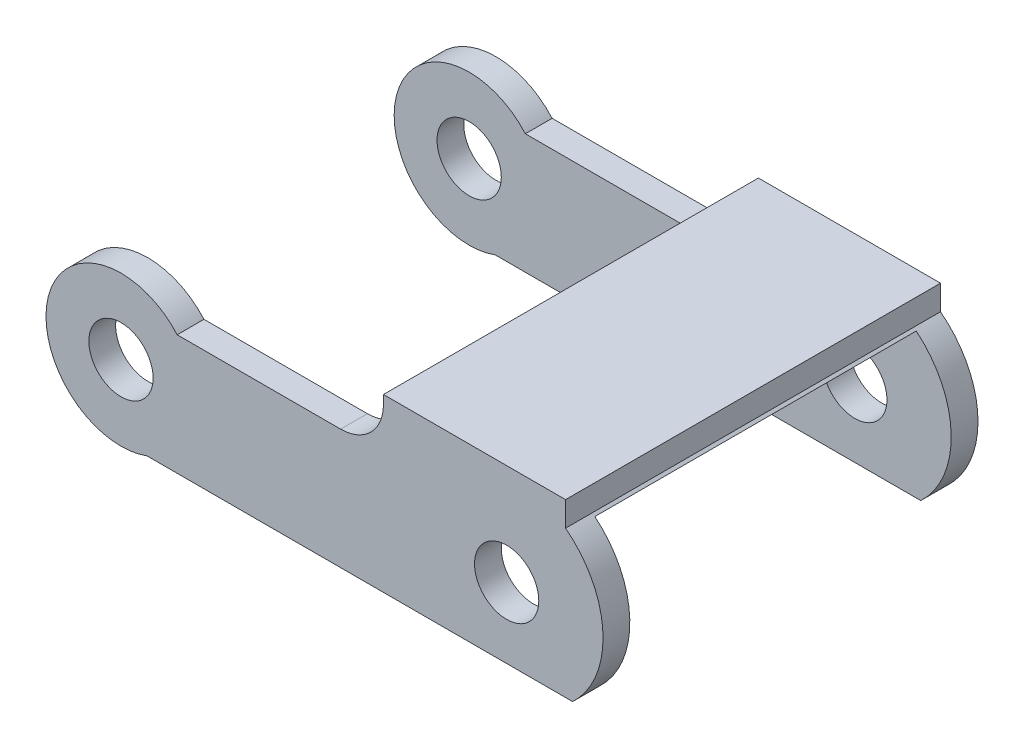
ISO-10303-21;
HEADER;
FILE_DESCRIPTION(('STEP AP214'),'2;1');
FILE_NAME('part.step','',(''),(''),'','','');
FILE_SCHEMA(('AUTOMOTIVE_DESIGN { 1 0 10303 214 1 1 1 1 }'));
ENDSEC;
DATA;
#1=APPLICATION_CONTEXT('core data for automotive mechanical design processes');
#2=APPLICATION_PROTOCOL_DEFINITION('international standard','automotive_design',2000,#1);
#3=PRODUCT_CONTEXT('',#1,'mechanical');
#4=PRODUCT('Part','Part','',(#3));
#5=PRODUCT_RELATED_PRODUCT_CATEGORY('part','',(#4));
#6=PRODUCT_DEFINITION_FORMATION('','',#4);
#7=PRODUCT_DEFINITION_CONTEXT('part definition',#1,'design');
#8=PRODUCT_DEFINITION('design','',#6,#7);
#9=PRODUCT_DEFINITION_SHAPE('','',#8);
#10=(LENGTH_UNIT() NAMED_UNIT(*) SI_UNIT(.MILLI.,.METRE.));
#11=(NAMED_UNIT(*) PLANE_ANGLE_UNIT() SI_UNIT($,.RADIAN.));
#12=(NAMED_UNIT(*) SI_UNIT($,.STERADIAN.) SOLID_ANGLE_UNIT());
#13=UNCERTAINTY_MEASURE_WITH_UNIT(LENGTH_MEASURE(1.E-05),#10,'distance_accuracy_value','');
#14=(GEOMETRIC_REPRESENTATION_CONTEXT(3) GLOBAL_UNCERTAINTY_ASSIGNED_CONTEXT((#13)) GLOBAL_UNIT_ASSIGNED_CONTEXT((#10,
#11,#12)) REPRESENTATION_CONTEXT('',''));
#15=CARTESIAN_POINT('',(0.,0.,0.));
#16=DIRECTION('',(0.,0.,1.));
#17=DIRECTION('',(1.,0.,0.));
#18=AXIS2_PLACEMENT_3D('',#15,#16,#17);
#19=CARTESIAN_POINT('',(-15.3771217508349,2.31743601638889,0.));
#20=DIRECTION('',(0.,1.,0.));
#21=DIRECTION('',(0.,0.,1.));
#22=AXIS2_PLACEMENT_3D('',#19,#20,#21);
#23=PLANE('',#22);
#24=DIRECTION('',(1.,0.,0.));
#25=VECTOR('',#24,1.);
#26=CARTESIAN_POINT('',(-8.08995792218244,2.3174360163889,-8.75));
#27=LINE('',#26,#25);
#28=CARTESIAN_POINT('',(-7.75,2.3174360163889,-8.75));
#29=VERTEX_POINT('',#28);
#30=CARTESIAN_POINT('',(-15.3771217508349,2.3174360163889,-8.75));
#31=VERTEX_POINT('',#30);
#32=EDGE_CURVE('E109',#29,#31,#27,.F.);
#33=ORIENTED_EDGE('',*,*,#32,.T.);
#34=DIRECTION('',(0.,0.,1.));
#35=VECTOR('',#34,1.);
#36=CARTESIAN_POINT('',(-15.3771217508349,2.31743601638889,0.));
#37=LINE('',#36,#35);
#38=CARTESIAN_POINT('',(-15.3771217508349,2.31743601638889,-7.5));
#39=VERTEX_POINT('',#38);
#40=EDGE_CURVE('E127',#39,#31,#37,.F.);
#41=ORIENTED_EDGE('',*,*,#40,.F.);
#42=DIRECTION('',(-1.,0.,0.));
#43=VECTOR('',#42,1.);
#44=CARTESIAN_POINT('',(7.84633971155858,2.31743601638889,-7.50000000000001));
#45=LINE('',#44,#43);
#46=CARTESIAN_POINT('',(-7.75,2.31743601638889,-7.5));
#47=VERTEX_POINT('',#46);
#48=EDGE_CURVE('E228',#39,#47,#45,.F.);
#49=ORIENTED_EDGE('',*,*,#48,.T.);
#50=DIRECTION('',(0.,0.,1.));
#51=VECTOR('',#50,1.);
#52=CARTESIAN_POINT('',(-7.75,2.31743601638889,0.));
#53=LINE('',#52,#51);
#54=EDGE_CURVE('E160',#47,#29,#53,.F.);
#55=ORIENTED_EDGE('',*,*,#54,.T.);
#56=EDGE_LOOP('',(#33,#41,#49,#55));
#57=FACE_BOUND('',#56,.T.);
#58=ADVANCED_FACE('F16',(#57),#23,.T.);
#59=CARTESIAN_POINT('',(3.07811203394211,-3.2825639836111,0.));
#60=DIRECTION('',(0.,-1.,0.));
#61=DIRECTION('',(0.,0.,-1.));
#62=AXIS2_PLACEMENT_3D('',#59,#60,#61);
#63=PLANE('',#62);
#64=DIRECTION('',(1.,0.,0.));
#65=VECTOR('',#64,1.);
#66=CARTESIAN_POINT('',(-8.08995792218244,-3.2825639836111,-8.75));
#67=LINE('',#66,#65);
#68=CARTESIAN_POINT('',(-16.7855973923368,-3.2825639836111,-8.75));
#69=VERTEX_POINT('',#68);
#70=CARTESIAN_POINT('',(3.07811203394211,-3.2825639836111,-8.75));
#71=VERTEX_POINT('',#70);
#72=EDGE_CURVE('E119',#69,#71,#67,.T.);
#73=ORIENTED_EDGE('',*,*,#72,.T.);
#74=DIRECTION('',(0.,0.,-1.));
#75=VECTOR('',#74,1.);
#76=CARTESIAN_POINT('',(3.07811203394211,-3.2825639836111,0.));
#77=LINE('',#76,#75);
#78=CARTESIAN_POINT('',(3.07811203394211,-3.2825639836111,-7.50000000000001));
#79=VERTEX_POINT('',#78);
#80=EDGE_CURVE('E158',#71,#79,#77,.F.);
#81=ORIENTED_EDGE('',*,*,#80,.T.);
#82=DIRECTION('',(-1.,0.,0.));
#83=VECTOR('',#82,1.);
#84=CARTESIAN_POINT('',(7.84633971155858,-3.2825639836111,-7.50000000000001));
#85=LINE('',#84,#83);
#86=CARTESIAN_POINT('',(-16.7855973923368,-3.2825639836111,-7.5));
#87=VERTEX_POINT('',#86);
#88=EDGE_CURVE('E122',#79,#87,#85,.T.);
#89=ORIENTED_EDGE('',*,*,#88,.T.);
#90=DIRECTION('',(0.,0.,1.));
#91=VECTOR('',#90,1.);
#92=CARTESIAN_POINT('',(-16.7855973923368,-3.2825639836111,0.));
#93=LINE('',#92,#91);
#94=EDGE_CURVE('E115',#69,#87,#93,.T.);
#95=ORIENTED_EDGE('',*,*,#94,.F.);
#96=EDGE_LOOP('',(#73,#81,#89,#95));
#97=FACE_BOUND('',#96,.T.);
#98=ADVANCED_FACE('F117',(#97),#63,.T.);
#99=CARTESIAN_POINT('',(-18.,0.,0.));
#100=DIRECTION('',(0.,0.,1.));
#101=DIRECTION('',(1.,0.,0.));
#102=AXIS2_PLACEMENT_3D('',#99,#100,#101);
#103=CYLINDRICAL_SURFACE('',#102,3.5);
#104=CARTESIAN_POINT('',(-18.,0.,-8.75));
#105=DIRECTION('',(0.,0.,1.));
#106=DIRECTION('',(1.,0.,0.));
#107=AXIS2_PLACEMENT_3D('',#104,#105,#106);
#108=CIRCLE('',#107,3.5);
#109=EDGE_CURVE('E19',#31,#69,#108,.T.);
#110=ORIENTED_EDGE('',*,*,#109,.T.);
#111=ORIENTED_EDGE('',*,*,#94,.T.);
#112=CARTESIAN_POINT('',(-18.,0.,-7.5));
#113=DIRECTION('',(0.,0.,1.));
#114=DIRECTION('',(1.,0.,0.));
#115=AXIS2_PLACEMENT_3D('',#112,#113,#114);
#116=CIRCLE('',#115,3.5);
#117=EDGE_CURVE('E220',#87,#39,#116,.F.);
#118=ORIENTED_EDGE('',*,*,#117,.T.);
#119=ORIENTED_EDGE('',*,*,#40,.T.);
#120=EDGE_LOOP('',(#110,#111,#118,#119));
#121=FACE_BOUND('',#120,.T.);
#122=ADVANCED_FACE('F130',(#121),#103,.T.);
#123=CARTESIAN_POINT('',(0.,0.,0.));
#124=DIRECTION('',(0.,0.,1.));
#125=DIRECTION('',(1.,0.,0.));
#126=AXIS2_PLACEMENT_3D('',#123,#124,#125);
#127=CYLINDRICAL_SURFACE('',#126,1.5);
#128=CARTESIAN_POINT('',(0.,0.,-8.75));
#129=DIRECTION('',(0.,0.,1.));
#130=DIRECTION('',(1.,0.,0.));
#131=AXIS2_PLACEMENT_3D('',#128,#129,#130);
#132=CIRCLE('',#131,1.5);
#133=CARTESIAN_POINT('',(1.5,0.,-8.75));
#134=VERTEX_POINT('',#133);
#135=EDGE_CURVE('E138',#134,#134,#132,.F.);
#136=ORIENTED_EDGE('',*,*,#135,.T.);
#137=EDGE_LOOP('',(#136));
#138=FACE_BOUND('',#137,.T.);
#139=CARTESIAN_POINT('',(0.,0.,-7.50000000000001));
#140=DIRECTION('',(0.,0.,1.));
#141=DIRECTION('',(1.,0.,0.));
#142=AXIS2_PLACEMENT_3D('',#139,#140,#141);
#143=CIRCLE('',#142,1.5);
#144=CARTESIAN_POINT('',(1.5,0.,-7.50000000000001));
#145=VERTEX_POINT('',#144);
#146=EDGE_CURVE('E217',#145,#145,#143,.T.);
#147=ORIENTED_EDGE('',*,*,#146,.T.);
#148=EDGE_LOOP('',(#147));
#149=FACE_BOUND('',#148,.T.);
#150=ADVANCED_FACE('F347',(#138,#149),#127,.F.);
#151=CARTESIAN_POINT('',(-18.,0.,0.));
#152=DIRECTION('',(0.,0.,1.));
#153=DIRECTION('',(1.,0.,0.));
#154=AXIS2_PLACEMENT_3D('',#151,#152,#153);
#155=CYLINDRICAL_SURFACE('',#154,1.5);
#156=CARTESIAN_POINT('',(-18.,0.,-8.75));
#157=DIRECTION('',(0.,0.,1.));
#158=DIRECTION('',(1.,0.,0.));
#159=AXIS2_PLACEMENT_3D('',#156,#157,#158);
#160=CIRCLE('',#159,1.5);
#161=CARTESIAN_POINT('',(-16.5,0.,-8.75));
#162=VERTEX_POINT('',#161);
#163=EDGE_CURVE('E135',#162,#162,#160,.F.);
#164=ORIENTED_EDGE('',*,*,#163,.T.);
#165=EDGE_LOOP('',(#164));
#166=FACE_BOUND('',#165,.T.);
#167=CARTESIAN_POINT('',(-18.,0.,-7.50000000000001));
#168=DIRECTION('',(0.,0.,1.));
#169=DIRECTION('',(1.,0.,0.));
#170=AXIS2_PLACEMENT_3D('',#167,#168,#169);
#171=CIRCLE('',#170,1.5);
#172=CARTESIAN_POINT('',(-16.5,0.,-7.50000000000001));
#173=VERTEX_POINT('',#172);
#174=EDGE_CURVE('E213',#173,#173,#171,.T.);
#175=ORIENTED_EDGE('',*,*,#174,.T.);
#176=EDGE_LOOP('',(#175));
#177=FACE_BOUND('',#176,.T.);
#178=ADVANCED_FACE('F344',(#166,#177),#155,.F.);
#179=CARTESIAN_POINT('',(2.75,4.7174360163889,0.));
#180=DIRECTION('',(1.,0.,0.));
#181=DIRECTION('',(0.,0.,-1.));
#182=AXIS2_PLACEMENT_3D('',#179,#180,#181);
#183=PLANE('',#182);
#184=DIRECTION('',(0.,1.,0.));
#185=VECTOR('',#184,1.);
#186=CARTESIAN_POINT('',(2.75,0.219715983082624,-8.75));
#187=LINE('',#186,#185);
#188=CARTESIAN_POINT('',(2.75,3.56195171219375,-8.75));
#189=VERTEX_POINT('',#188);
#190=CARTESIAN_POINT('',(2.75,4.7174360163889,-8.75));
#191=VERTEX_POINT('',#190);
#192=EDGE_CURVE('E144',#189,#191,#187,.T.);
#193=ORIENTED_EDGE('',*,*,#192,.T.);
#194=DIRECTION('',(0.,0.,1.));
#195=VECTOR('',#194,1.);
#196=CARTESIAN_POINT('',(2.75,4.71743601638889,0.));
#197=LINE('',#196,#195);
#198=CARTESIAN_POINT('',(2.75,4.7174360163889,8.75));
#199=VERTEX_POINT('',#198);
#200=EDGE_CURVE('E150',#199,#191,#197,.F.);
#201=ORIENTED_EDGE('',*,*,#200,.F.);
#202=DIRECTION('',(0.,1.,0.));
#203=VECTOR('',#202,1.);
#204=CARTESIAN_POINT('',(2.75,4.7174360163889,8.75));
#205=LINE('',#204,#203);
#206=CARTESIAN_POINT('',(2.75,3.56195171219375,8.75));
#207=VERTEX_POINT('',#206);
#208=EDGE_CURVE('E126',#199,#207,#205,.F.);
#209=ORIENTED_EDGE('',*,*,#208,.T.);
#210=DIRECTION('',(0.,0.,1.));
#211=VECTOR('',#210,1.);
#212=CARTESIAN_POINT('',(2.75,3.56195171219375,0.));
#213=LINE('',#212,#211);
#214=EDGE_CURVE('E205',#189,#207,#213,.T.);
#215=ORIENTED_EDGE('',*,*,#214,.F.);
#216=EDGE_LOOP('',(#193,#201,#209,#215));
#217=FACE_BOUND('',#216,.T.);
#218=ADVANCED_FACE('F265',(#217),#183,.T.);
#219=CARTESIAN_POINT('',(-8.08995792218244,0.219715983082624,-8.75));
#220=DIRECTION('',(0.,0.,1.));
#221=DIRECTION('',(1.,0.,0.));
#222=AXIS2_PLACEMENT_3D('',#219,#220,#221);
#223=PLANE('',#222);
#224=ORIENTED_EDGE('',*,*,#135,.F.);
#225=EDGE_LOOP('',(#224));
#226=FACE_BOUND('',#225,.T.);
#227=ORIENTED_EDGE('',*,*,#163,.F.);
#228=EDGE_LOOP('',(#227));
#229=FACE_BOUND('',#228,.T.);
#230=ORIENTED_EDGE('',*,*,#109,.F.);
#231=ORIENTED_EDGE('',*,*,#32,.F.);
#232=CARTESIAN_POINT('',(-7.75,4.3174360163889,-8.75));
#233=DIRECTION('',(0.,0.,1.));
#234=DIRECTION('',(1.,0.,0.));
#235=AXIS2_PLACEMENT_3D('',#232,#233,#234);
#236=CIRCLE('',#235,2.);
#237=CARTESIAN_POINT('',(-5.75,4.3174360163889,-8.75));
#238=VERTEX_POINT('',#237);
#239=EDGE_CURVE('E165',#29,#238,#236,.T.);
#240=ORIENTED_EDGE('',*,*,#239,.T.);
#241=DIRECTION('',(0.,1.,0.));
#242=VECTOR('',#241,1.);
#243=CARTESIAN_POINT('',(-5.75,4.3174360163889,-8.75));
#244=LINE('',#243,#242);
#245=CARTESIAN_POINT('',(-5.75,4.71743601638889,-8.75));
#246=VERTEX_POINT('',#245);
#247=EDGE_CURVE('E141',#246,#238,#244,.F.);
#248=ORIENTED_EDGE('',*,*,#247,.F.);
#249=DIRECTION('',(1.,0.,0.));
#250=VECTOR('',#249,1.);
#251=CARTESIAN_POINT('',(-5.75,4.71743601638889,-8.75));
#252=LINE('',#251,#250);
#253=EDGE_CURVE('E166',#191,#246,#252,.F.);
#254=ORIENTED_EDGE('',*,*,#253,.F.);
#255=ORIENTED_EDGE('',*,*,#192,.F.);
#256=CARTESIAN_POINT('',(0.,0.,-8.75));
#257=DIRECTION('',(0.,0.,1.));
#258=DIRECTION('',(1.,0.,0.));
#259=AXIS2_PLACEMENT_3D('',#256,#257,#258);
#260=CIRCLE('',#259,4.5);
#261=EDGE_CURVE('E134',#71,#189,#260,.T.);
#262=ORIENTED_EDGE('',*,*,#261,.F.);
#263=ORIENTED_EDGE('',*,*,#72,.F.);
#264=EDGE_LOOP('',(#230,#231,#240,#248,#254,#255,#262,#263));
#265=FACE_BOUND('',#264,.T.);
#266=ADVANCED_FACE('F132',(#226,#229,#265),#223,.F.);
#267=CARTESIAN_POINT('',(-5.75,4.3174360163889,0.));
#268=DIRECTION('',(-1.,0.,0.));
#269=DIRECTION('',(0.,0.,1.));
#270=AXIS2_PLACEMENT_3D('',#267,#268,#269);
#271=PLANE('',#270);
#272=ORIENTED_EDGE('',*,*,#247,.T.);
#273=DIRECTION('',(0.,0.,1.));
#274=VECTOR('',#273,1.);
#275=CARTESIAN_POINT('',(-5.75,4.3174360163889,0.));
#276=LINE('',#275,#274);
#277=CARTESIAN_POINT('',(-5.75,4.3174360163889,8.75));
#278=VERTEX_POINT('',#277);
#279=EDGE_CURVE('E200',#238,#278,#276,.T.);
#280=ORIENTED_EDGE('',*,*,#279,.T.);
#281=DIRECTION('',(0.,1.,0.));
#282=VECTOR('',#281,1.);
#283=CARTESIAN_POINT('',(-5.75,4.3174360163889,8.75));
#284=LINE('',#283,#282);
#285=CARTESIAN_POINT('',(-5.75,4.71743601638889,8.75));
#286=VERTEX_POINT('',#285);
#287=EDGE_CURVE('E34',#278,#286,#284,.T.);
#288=ORIENTED_EDGE('',*,*,#287,.T.);
#289=DIRECTION('',(0.,0.,1.));
#290=VECTOR('',#289,1.);
#291=CARTESIAN_POINT('',(-5.75,4.71743601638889,0.));
#292=LINE('',#291,#290);
#293=EDGE_CURVE('E162',#246,#286,#292,.T.);
#294=ORIENTED_EDGE('',*,*,#293,.F.);
#295=EDGE_LOOP('',(#272,#280,#288,#294));
#296=FACE_BOUND('',#295,.T.);
#297=ADVANCED_FACE('F271',(#296),#271,.T.);
#298=CARTESIAN_POINT('',(-8.76491090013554,3.46743601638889,0.));
#299=DIRECTION('',(0.,1.,0.));
#300=DIRECTION('',(0.,0.,1.));
#301=AXIS2_PLACEMENT_3D('',#298,#299,#300);
#302=PLANE('',#301);
#303=DIRECTION('',(-1.,0.,0.));
#304=VECTOR('',#303,1.);
#305=CARTESIAN_POINT('',(7.84633971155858,3.46743601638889,-7.50000000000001));
#306=LINE('',#305,#304);
#307=CARTESIAN_POINT('',(-5.93961330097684,3.46743601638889,-7.5));
#308=VERTEX_POINT('',#307);
#309=CARTESIAN_POINT('',(2.86825512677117,3.4674360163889,-7.50000000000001));
#310=VERTEX_POINT('',#309);
#311=EDGE_CURVE('E235',#308,#310,#306,.F.);
#312=ORIENTED_EDGE('',*,*,#311,.T.);
#313=DIRECTION('',(0.,0.,1.));
#314=VECTOR('',#313,1.);
#315=CARTESIAN_POINT('',(2.86825512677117,3.4674360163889,0.));
#316=LINE('',#315,#314);
#317=CARTESIAN_POINT('',(2.86825512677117,3.4674360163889,7.5));
#318=VERTEX_POINT('',#317);
#319=EDGE_CURVE('E147',#318,#310,#316,.F.);
#320=ORIENTED_EDGE('',*,*,#319,.F.);
#321=DIRECTION('',(1.,0.,0.));
#322=VECTOR('',#321,1.);
#323=CARTESIAN_POINT('',(-25.3761615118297,3.4674360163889,7.5));
#324=LINE('',#323,#322);
#325=CARTESIAN_POINT('',(-5.93961330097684,3.4674360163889,7.5));
#326=VERTEX_POINT('',#325);
#327=EDGE_CURVE('E216',#318,#326,#324,.F.);
#328=ORIENTED_EDGE('',*,*,#327,.T.);
#329=DIRECTION('',(0.,0.,1.));
#330=VECTOR('',#329,1.);
#331=CARTESIAN_POINT('',(-5.93961330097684,3.46743601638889,0.));
#332=LINE('',#331,#330);
#333=EDGE_CURVE('E194',#326,#308,#332,.F.);
#334=ORIENTED_EDGE('',*,*,#333,.T.);
#335=EDGE_LOOP('',(#312,#320,#328,#334));
#336=FACE_BOUND('',#335,.T.);
#337=ADVANCED_FACE('F292',(#336),#302,.F.);
#338=CARTESIAN_POINT('',(7.84633971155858,3.4674360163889,-7.50000000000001));
#339=DIRECTION('',(0.,0.,-1.));
#340=DIRECTION('',(-1.,0.,0.));
#341=AXIS2_PLACEMENT_3D('',#338,#339,#340);
#342=PLANE('',#341);
#343=ORIENTED_EDGE('',*,*,#174,.F.);
#344=EDGE_LOOP('',(#343));
#345=FACE_BOUND('',#344,.T.);
#346=ORIENTED_EDGE('',*,*,#146,.F.);
#347=EDGE_LOOP('',(#346));
#348=FACE_BOUND('',#347,.T.);
#349=ORIENTED_EDGE('',*,*,#88,.F.);
#350=CARTESIAN_POINT('',(0.,0.,-7.50000000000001));
#351=DIRECTION('',(0.,0.,1.));
#352=DIRECTION('',(1.,0.,0.));
#353=AXIS2_PLACEMENT_3D('',#350,#351,#352);
#354=CIRCLE('',#353,4.5);
#355=EDGE_CURVE('E206',#310,#79,#354,.F.);
#356=ORIENTED_EDGE('',*,*,#355,.F.);
#357=ORIENTED_EDGE('',*,*,#311,.F.);
#358=CARTESIAN_POINT('',(-7.75,4.3174360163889,-7.5));
#359=DIRECTION('',(0.,0.,1.));
#360=DIRECTION('',(1.,0.,0.));
#361=AXIS2_PLACEMENT_3D('',#358,#359,#360);
#362=CIRCLE('',#361,2.);
#363=EDGE_CURVE('E191',#308,#47,#362,.F.);
#364=ORIENTED_EDGE('',*,*,#363,.T.);
#365=ORIENTED_EDGE('',*,*,#48,.F.);
#366=ORIENTED_EDGE('',*,*,#117,.F.);
#367=EDGE_LOOP('',(#349,#356,#357,#364,#365,#366));
#368=FACE_BOUND('',#367,.T.);
#369=ADVANCED_FACE('F295',(#345,#348,#368),#342,.F.);
#370=CARTESIAN_POINT('',(-25.3761615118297,3.46743601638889,7.5));
#371=DIRECTION('',(0.,0.,1.));
#372=DIRECTION('',(1.,0.,0.));
#373=AXIS2_PLACEMENT_3D('',#370,#371,#372);
#374=PLANE('',#373);
#375=CARTESIAN_POINT('',(0.,0.,7.5));
#376=DIRECTION('',(0.,0.,1.));
#377=DIRECTION('',(1.,0.,0.));
#378=AXIS2_PLACEMENT_3D('',#375,#376,#377);
#379=CIRCLE('',#378,1.5);
#380=CARTESIAN_POINT('',(1.5,0.,7.5));
#381=VERTEX_POINT('',#380);
#382=EDGE_CURVE('E185',#381,#381,#379,.T.);
#383=ORIENTED_EDGE('',*,*,#382,.T.);
#384=EDGE_LOOP('',(#383));
#385=FACE_BOUND('',#384,.T.);
#386=CARTESIAN_POINT('',(-18.,0.,7.5));
#387=DIRECTION('',(0.,0.,1.));
#388=DIRECTION('',(1.,0.,0.));
#389=AXIS2_PLACEMENT_3D('',#386,#387,#388);
#390=CIRCLE('',#389,1.5);
#391=CARTESIAN_POINT('',(-16.5,0.,7.5));
#392=VERTEX_POINT('',#391);
#393=EDGE_CURVE('E188',#392,#392,#390,.T.);
#394=ORIENTED_EDGE('',*,*,#393,.T.);
#395=EDGE_LOOP('',(#394));
#396=FACE_BOUND('',#395,.T.);
#397=DIRECTION('',(1.,0.,0.));
#398=VECTOR('',#397,1.);
#399=CARTESIAN_POINT('',(-15.3771217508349,2.31743601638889,7.5));
#400=LINE('',#399,#398);
#401=CARTESIAN_POINT('',(-7.75,2.3174360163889,7.5));
#402=VERTEX_POINT('',#401);
#403=CARTESIAN_POINT('',(-15.3771217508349,2.31743601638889,7.5));
#404=VERTEX_POINT('',#403);
#405=EDGE_CURVE('E212',#402,#404,#400,.F.);
#406=ORIENTED_EDGE('',*,*,#405,.F.);
#407=CARTESIAN_POINT('',(-7.75,4.3174360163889,7.5));
#408=DIRECTION('',(0.,0.,1.));
#409=DIRECTION('',(1.,0.,0.));
#410=AXIS2_PLACEMENT_3D('',#407,#408,#409);
#411=CIRCLE('',#410,2.);
#412=EDGE_CURVE('E195',#402,#326,#411,.T.);
#413=ORIENTED_EDGE('',*,*,#412,.T.);
#414=ORIENTED_EDGE('',*,*,#327,.F.);
#415=CARTESIAN_POINT('',(0.,0.,7.5));
#416=DIRECTION('',(0.,0.,1.));
#417=DIRECTION('',(1.,0.,0.));
#418=AXIS2_PLACEMENT_3D('',#415,#416,#417);
#419=CIRCLE('',#418,4.5);
#420=CARTESIAN_POINT('',(3.07811203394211,-3.2825639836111,7.5));
#421=VERTEX_POINT('',#420);
#422=EDGE_CURVE('E151',#421,#318,#419,.T.);
#423=ORIENTED_EDGE('',*,*,#422,.F.);
#424=DIRECTION('',(1.,0.,0.));
#425=VECTOR('',#424,1.);
#426=CARTESIAN_POINT('',(3.07811203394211,-3.2825639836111,7.5));
#427=LINE('',#426,#425);
#428=CARTESIAN_POINT('',(-16.7855973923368,-3.2825639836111,7.5));
#429=VERTEX_POINT('',#428);
#430=EDGE_CURVE('E152',#429,#421,#427,.T.);
#431=ORIENTED_EDGE('',*,*,#430,.F.);
#432=CARTESIAN_POINT('',(-18.,0.,7.5));
#433=DIRECTION('',(0.,0.,1.));
#434=DIRECTION('',(1.,0.,0.));
#435=AXIS2_PLACEMENT_3D('',#432,#433,#434);
#436=CIRCLE('',#435,3.5);
#437=EDGE_CURVE('E209',#404,#429,#436,.T.);
#438=ORIENTED_EDGE('',*,*,#437,.F.);
#439=EDGE_LOOP('',(#406,#413,#414,#423,#431,#438));
#440=FACE_BOUND('',#439,.T.);
#441=ADVANCED_FACE('F288',(#385,#396,#440),#374,.F.);
#442=CARTESIAN_POINT('',(-15.3771217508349,2.31743601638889,0.));
#443=DIRECTION('',(0.,1.,0.));
#444=DIRECTION('',(0.,0.,1.));
#445=AXIS2_PLACEMENT_3D('',#442,#443,#444);
#446=PLANE('',#445);
#447=DIRECTION('',(1.,0.,0.));
#448=VECTOR('',#447,1.);
#449=CARTESIAN_POINT('',(-8.08995792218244,2.3174360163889,8.75));
#450=LINE('',#449,#448);
#451=CARTESIAN_POINT('',(-7.75,2.3174360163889,8.75));
#452=VERTEX_POINT('',#451);
#453=CARTESIAN_POINT('',(-15.3771217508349,2.3174360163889,8.75));
#454=VERTEX_POINT('',#453);
#455=EDGE_CURVE('E184',#452,#454,#450,.F.);
#456=ORIENTED_EDGE('',*,*,#455,.F.);
#457=DIRECTION('',(0.,0.,1.));
#458=VECTOR('',#457,1.);
#459=CARTESIAN_POINT('',(-7.75,2.3174360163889,0.));
#460=LINE('',#459,#458);
#461=EDGE_CURVE('E198',#452,#402,#460,.F.);
#462=ORIENTED_EDGE('',*,*,#461,.T.);
#463=ORIENTED_EDGE('',*,*,#405,.T.);
#464=DIRECTION('',(0.,0.,1.));
#465=VECTOR('',#464,1.);
#466=CARTESIAN_POINT('',(-15.3771217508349,2.31743601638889,0.));
#467=LINE('',#466,#465);
#468=EDGE_CURVE('E155',#454,#404,#467,.F.);
#469=ORIENTED_EDGE('',*,*,#468,.F.);
#470=EDGE_LOOP('',(#456,#462,#463,#469));
#471=FACE_BOUND('',#470,.T.);
#472=ADVANCED_FACE('F284',(#471),#446,.T.);
#473=CARTESIAN_POINT('',(-18.,0.,0.));
#474=DIRECTION('',(0.,0.,1.));
#475=DIRECTION('',(1.,0.,0.));
#476=AXIS2_PLACEMENT_3D('',#473,#474,#475);
#477=CYLINDRICAL_SURFACE('',#476,3.5);
#478=CARTESIAN_POINT('',(-18.,0.,8.75));
#479=DIRECTION('',(0.,0.,1.));
#480=DIRECTION('',(1.,0.,0.));
#481=AXIS2_PLACEMENT_3D('',#478,#479,#480);
#482=CIRCLE('',#481,3.5);
#483=CARTESIAN_POINT('',(-16.7855973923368,-3.2825639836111,8.75));
#484=VERTEX_POINT('',#483);
#485=EDGE_CURVE('E181',#454,#484,#482,.T.);
#486=ORIENTED_EDGE('',*,*,#485,.F.);
#487=ORIENTED_EDGE('',*,*,#468,.T.);
#488=ORIENTED_EDGE('',*,*,#437,.T.);
#489=DIRECTION('',(0.,0.,-1.));
#490=VECTOR('',#489,1.);
#491=CARTESIAN_POINT('',(-16.7855973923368,-3.2825639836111,0.));
#492=LINE('',#491,#490);
#493=EDGE_CURVE('E154',#484,#429,#492,.T.);
#494=ORIENTED_EDGE('',*,*,#493,.F.);
#495=EDGE_LOOP('',(#486,#487,#488,#494));
#496=FACE_BOUND('',#495,.T.);
#497=ADVANCED_FACE('F286',(#496),#477,.T.);
#498=CARTESIAN_POINT('',(3.07811203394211,-3.2825639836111,0.));
#499=DIRECTION('',(0.,-1.,0.));
#500=DIRECTION('',(0.,0.,-1.));
#501=AXIS2_PLACEMENT_3D('',#498,#499,#500);
#502=PLANE('',#501);
#503=DIRECTION('',(1.,0.,0.));
#504=VECTOR('',#503,1.);
#505=CARTESIAN_POINT('',(-8.08995792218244,-3.2825639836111,8.75));
#506=LINE('',#505,#504);
#507=CARTESIAN_POINT('',(3.07811203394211,-3.2825639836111,8.75));
#508=VERTEX_POINT('',#507);
#509=EDGE_CURVE('E180',#484,#508,#506,.T.);
#510=ORIENTED_EDGE('',*,*,#509,.F.);
#511=ORIENTED_EDGE('',*,*,#493,.T.);
#512=ORIENTED_EDGE('',*,*,#430,.T.);
#513=DIRECTION('',(0.,0.,1.));
#514=VECTOR('',#513,1.);
#515=CARTESIAN_POINT('',(3.07811203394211,-3.2825639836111,0.));
#516=LINE('',#515,#514);
#517=EDGE_CURVE('E203',#508,#421,#516,.F.);
#518=ORIENTED_EDGE('',*,*,#517,.F.);
#519=EDGE_LOOP('',(#510,#511,#512,#518));
#520=FACE_BOUND('',#519,.T.);
#521=ADVANCED_FACE('F259',(#520),#502,.T.);
#522=CARTESIAN_POINT('',(0.,0.,0.));
#523=DIRECTION('',(0.,0.,1.));
#524=DIRECTION('',(1.,0.,0.));
#525=AXIS2_PLACEMENT_3D('',#522,#523,#524);
#526=CYLINDRICAL_SURFACE('',#525,4.5);
#527=ORIENTED_EDGE('',*,*,#422,.T.);
#528=ORIENTED_EDGE('',*,*,#319,.T.);
#529=ORIENTED_EDGE('',*,*,#355,.T.);
#530=ORIENTED_EDGE('',*,*,#80,.F.);
#531=ORIENTED_EDGE('',*,*,#261,.T.);
#532=ORIENTED_EDGE('',*,*,#214,.T.);
#533=CARTESIAN_POINT('',(0.,0.,8.75));
#534=DIRECTION('',(0.,0.,1.));
#535=DIRECTION('',(1.,0.,0.));
#536=AXIS2_PLACEMENT_3D('',#533,#534,#535);
#537=CIRCLE('',#536,4.5);
#538=EDGE_CURVE('E172',#508,#207,#537,.T.);
#539=ORIENTED_EDGE('',*,*,#538,.F.);
#540=ORIENTED_EDGE('',*,*,#517,.T.);
#541=EDGE_LOOP('',(#527,#528,#529,#530,#531,#532,#539,#540));
#542=FACE_BOUND('',#541,.T.);
#543=ADVANCED_FACE('F262',(#542),#526,.T.);
#544=CARTESIAN_POINT('',(-5.75,4.71743601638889,0.));
#545=DIRECTION('',(0.,1.,0.));
#546=DIRECTION('',(0.,0.,1.));
#547=AXIS2_PLACEMENT_3D('',#544,#545,#546);
#548=PLANE('',#547);
#549=ORIENTED_EDGE('',*,*,#253,.T.);
#550=ORIENTED_EDGE('',*,*,#293,.T.);
#551=DIRECTION('',(1.,0.,0.));
#552=VECTOR('',#551,1.);
#553=CARTESIAN_POINT('',(-8.08995792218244,4.7174360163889,8.75));
#554=LINE('',#553,#552);
#555=EDGE_CURVE('E169',#199,#286,#554,.F.);
#556=ORIENTED_EDGE('',*,*,#555,.F.);
#557=ORIENTED_EDGE('',*,*,#200,.T.);
#558=EDGE_LOOP('',(#549,#550,#556,#557));
#559=FACE_BOUND('',#558,.T.);
#560=ADVANCED_FACE('F270',(#559),#548,.T.);
#561=CARTESIAN_POINT('',(-7.75,4.3174360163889,0.));
#562=DIRECTION('',(0.,0.,1.));
#563=DIRECTION('',(1.,0.,0.));
#564=AXIS2_PLACEMENT_3D('',#561,#562,#563);
#565=CYLINDRICAL_SURFACE('',#564,2.);
#566=ORIENTED_EDGE('',*,*,#333,.F.);
#567=ORIENTED_EDGE('',*,*,#412,.F.);
#568=ORIENTED_EDGE('',*,*,#461,.F.);
#569=CARTESIAN_POINT('',(-7.75,4.3174360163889,8.75));
#570=DIRECTION('',(0.,0.,1.));
#571=DIRECTION('',(1.,0.,0.));
#572=AXIS2_PLACEMENT_3D('',#569,#570,#571);
#573=CIRCLE('',#572,2.);
#574=EDGE_CURVE('E171',#278,#452,#573,.F.);
#575=ORIENTED_EDGE('',*,*,#574,.F.);
#576=ORIENTED_EDGE('',*,*,#279,.F.);
#577=ORIENTED_EDGE('',*,*,#239,.F.);
#578=ORIENTED_EDGE('',*,*,#54,.F.);
#579=ORIENTED_EDGE('',*,*,#363,.F.);
#580=EDGE_LOOP('',(#566,#567,#568,#575,#576,#577,#578,#579));
#581=FACE_BOUND('',#580,.T.);
#582=ADVANCED_FACE('F278',(#581),#565,.F.);
#583=CARTESIAN_POINT('',(-18.,0.,0.));
#584=DIRECTION('',(0.,0.,1.));
#585=DIRECTION('',(1.,0.,0.));
#586=AXIS2_PLACEMENT_3D('',#583,#584,#585);
#587=CYLINDRICAL_SURFACE('',#586,1.5);
#588=ORIENTED_EDGE('',*,*,#393,.F.);
#589=EDGE_LOOP('',(#588));
#590=FACE_BOUND('',#589,.T.);
#591=CARTESIAN_POINT('',(-18.,0.,8.75));
#592=DIRECTION('',(0.,0.,1.));
#593=DIRECTION('',(1.,0.,0.));
#594=AXIS2_PLACEMENT_3D('',#591,#592,#593);
#595=CIRCLE('',#594,1.5);
#596=CARTESIAN_POINT('',(-16.5,0.,8.75));
#597=VERTEX_POINT('',#596);
#598=EDGE_CURVE('E25',#597,#597,#595,.F.);
#599=ORIENTED_EDGE('',*,*,#598,.F.);
#600=EDGE_LOOP('',(#599));
#601=FACE_BOUND('',#600,.T.);
#602=ADVANCED_FACE('F309',(#590,#601),#587,.F.);
#603=CARTESIAN_POINT('',(0.,0.,0.));
#604=DIRECTION('',(0.,0.,1.));
#605=DIRECTION('',(1.,0.,0.));
#606=AXIS2_PLACEMENT_3D('',#603,#604,#605);
#607=CYLINDRICAL_SURFACE('',#606,1.5);
#608=ORIENTED_EDGE('',*,*,#382,.F.);
#609=EDGE_LOOP('',(#608));
#610=FACE_BOUND('',#609,.T.);
#611=CARTESIAN_POINT('',(0.,0.,8.75));
#612=DIRECTION('',(0.,0.,1.));
#613=DIRECTION('',(1.,0.,0.));
#614=AXIS2_PLACEMENT_3D('',#611,#612,#613);
#615=CIRCLE('',#614,1.5);
#616=CARTESIAN_POINT('',(1.5,0.,8.75));
#617=VERTEX_POINT('',#616);
#618=EDGE_CURVE('E11',#617,#617,#615,.F.);
#619=ORIENTED_EDGE('',*,*,#618,.F.);
#620=EDGE_LOOP('',(#619));
#621=FACE_BOUND('',#620,.T.);
#622=ADVANCED_FACE('F303',(#610,#621),#607,.F.);
#623=CARTESIAN_POINT('',(-8.08995792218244,0.219715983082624,8.75));
#624=DIRECTION('',(0.,0.,1.));
#625=DIRECTION('',(1.,0.,0.));
#626=AXIS2_PLACEMENT_3D('',#623,#624,#625);
#627=PLANE('',#626);
#628=ORIENTED_EDGE('',*,*,#618,.T.);
#629=EDGE_LOOP('',(#628));
#630=FACE_BOUND('',#629,.T.);
#631=ORIENTED_EDGE('',*,*,#598,.T.);
#632=EDGE_LOOP('',(#631));
#633=FACE_BOUND('',#632,.T.);
#634=ORIENTED_EDGE('',*,*,#287,.F.);
#635=ORIENTED_EDGE('',*,*,#574,.T.);
#636=ORIENTED_EDGE('',*,*,#455,.T.);
#637=ORIENTED_EDGE('',*,*,#485,.T.);
#638=ORIENTED_EDGE('',*,*,#509,.T.);
#639=ORIENTED_EDGE('',*,*,#538,.T.);
#640=ORIENTED_EDGE('',*,*,#208,.F.);
#641=ORIENTED_EDGE('',*,*,#555,.T.);
#642=EDGE_LOOP('',(#634,#635,#636,#637,#638,#639,#640,#641));
#643=FACE_BOUND('',#642,.T.);
#644=ADVANCED_FACE('F254',(#630,#633,#643),#627,.T.);
#645=CLOSED_SHELL('',(#58,#98,#122,#150,#178,#218,#266,#297,#337,#369,#441,#472,#497,#521,#543,
#560,#582,#602,#622,#644));
#646=MANIFOLD_SOLID_BREP('B1',#645);
#647=ADVANCED_BREP_SHAPE_REPRESENTATION('',(#18,#646),#14);
#648=SHAPE_DEFINITION_REPRESENTATION(#9,#647);
ENDSEC;
END-ISO-10303-21;
